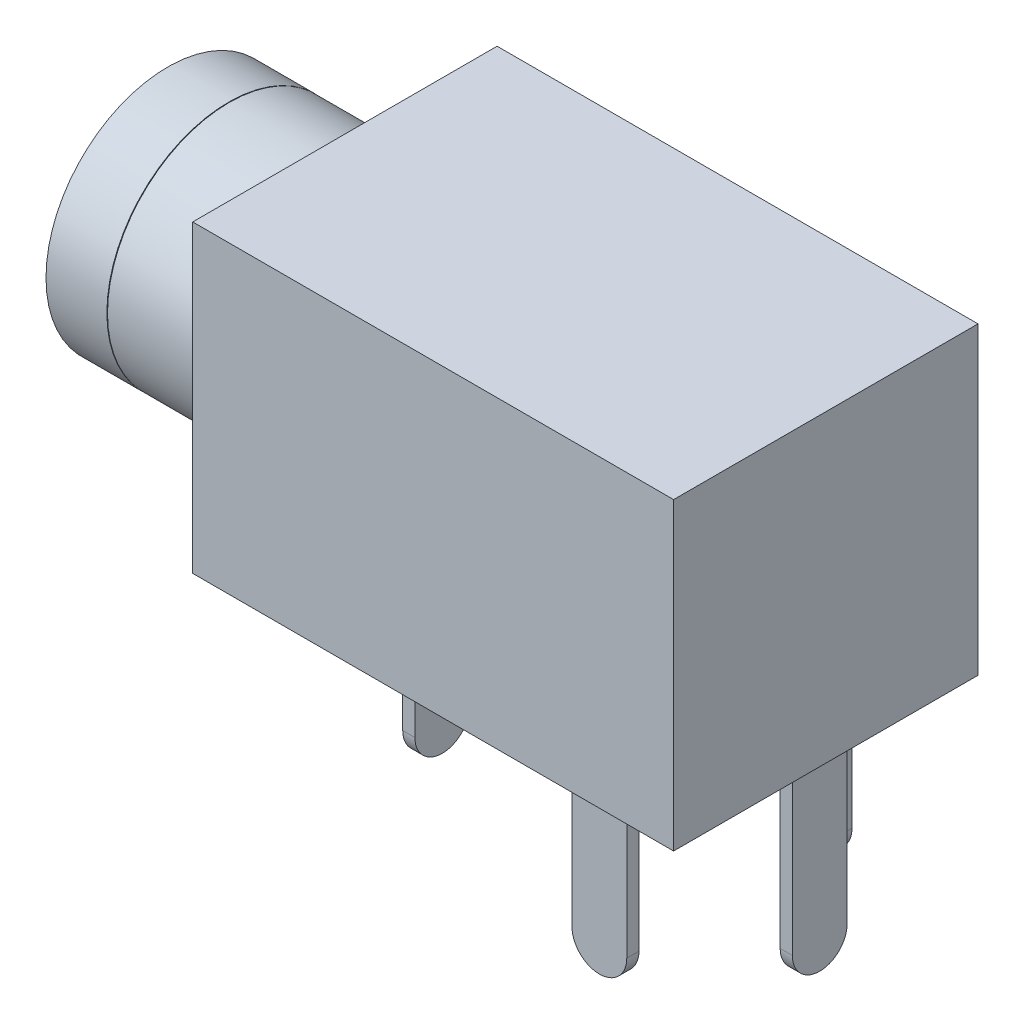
ISO-10303-21;
HEADER;
FILE_DESCRIPTION(('STEP AP214'),'2;1');
FILE_NAME('part.step','',(''),(''),'','','');
FILE_SCHEMA(('AUTOMOTIVE_DESIGN { 1 0 10303 214 1 1 1 1 }'));
ENDSEC;
DATA;
#1=APPLICATION_CONTEXT('core data for automotive mechanical design processes');
#2=APPLICATION_PROTOCOL_DEFINITION('international standard','automotive_design',2000,#1);
#3=PRODUCT_CONTEXT('',#1,'mechanical');
#4=PRODUCT('Part','Part','',(#3));
#5=PRODUCT_RELATED_PRODUCT_CATEGORY('part','',(#4));
#6=PRODUCT_DEFINITION_FORMATION('','',#4);
#7=PRODUCT_DEFINITION_CONTEXT('part definition',#1,'design');
#8=PRODUCT_DEFINITION('design','',#6,#7);
#9=PRODUCT_DEFINITION_SHAPE('','',#8);
#10=(LENGTH_UNIT() NAMED_UNIT(*) SI_UNIT(.MILLI.,.METRE.));
#11=(NAMED_UNIT(*) PLANE_ANGLE_UNIT() SI_UNIT($,.RADIAN.));
#12=(NAMED_UNIT(*) SI_UNIT($,.STERADIAN.) SOLID_ANGLE_UNIT());
#13=UNCERTAINTY_MEASURE_WITH_UNIT(LENGTH_MEASURE(1.E-05),#10,'distance_accuracy_value','');
#14=(GEOMETRIC_REPRESENTATION_CONTEXT(3) GLOBAL_UNCERTAINTY_ASSIGNED_CONTEXT((#13)) GLOBAL_UNIT_ASSIGNED_CONTEXT((#10,
#11,#12)) REPRESENTATION_CONTEXT('',''));
#15=CARTESIAN_POINT('',(0.,0.,0.));
#16=DIRECTION('',(0.,0.,1.));
#17=DIRECTION('',(1.,0.,0.));
#18=AXIS2_PLACEMENT_3D('',#15,#16,#17);
#19=CARTESIAN_POINT('',(1.4,-3.01,0.449999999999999));
#20=DIRECTION('',(1.,0.,0.));
#21=DIRECTION('',(0.,0.,-1.));
#22=AXIS2_PLACEMENT_3D('',#19,#20,#21);
#23=PLANE('',#22);
#24=CARTESIAN_POINT('',(1.4,-2.56,0.));
#25=DIRECTION('',(1.,0.,0.));
#26=DIRECTION('',(0.,0.,-1.));
#27=AXIS2_PLACEMENT_3D('',#24,#25,#26);
#28=CIRCLE('',#27,0.45);
#29=CARTESIAN_POINT('',(1.4,-2.56,-0.450000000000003));
#30=VERTEX_POINT('',#29);
#31=CARTESIAN_POINT('',(1.4,-3.01,0.));
#32=VERTEX_POINT('',#31);
#33=EDGE_CURVE('E94',#30,#32,#28,.F.);
#34=ORIENTED_EDGE('',*,*,#33,.T.);
#35=CARTESIAN_POINT('',(1.4,-2.56,0.));
#36=DIRECTION('',(1.,0.,0.));
#37=DIRECTION('',(0.,0.,-1.));
#38=AXIS2_PLACEMENT_3D('',#35,#36,#37);
#39=CIRCLE('',#38,0.45);
#40=CARTESIAN_POINT('',(1.4,-2.56,0.449999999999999));
#41=VERTEX_POINT('',#40);
#42=EDGE_CURVE('E121',#32,#41,#39,.F.);
#43=ORIENTED_EDGE('',*,*,#42,.T.);
#44=DIRECTION('',(0.,1.,0.));
#45=VECTOR('',#44,1.);
#46=CARTESIAN_POINT('',(1.4,-3.01,0.449999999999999));
#47=LINE('',#46,#45);
#48=CARTESIAN_POINT('',(1.4,-0.01,0.449999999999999));
#49=VERTEX_POINT('',#48);
#50=EDGE_CURVE('E106',#41,#49,#47,.T.);
#51=ORIENTED_EDGE('',*,*,#50,.T.);
#52=DIRECTION('',(0.,0.,-1.));
#53=VECTOR('',#52,1.);
#54=CARTESIAN_POINT('',(1.4,-0.01,0.449999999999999));
#55=LINE('',#54,#53);
#56=CARTESIAN_POINT('',(1.4,-0.01,-0.450000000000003));
#57=VERTEX_POINT('',#56);
#58=EDGE_CURVE('E101',#49,#57,#55,.T.);
#59=ORIENTED_EDGE('',*,*,#58,.T.);
#60=DIRECTION('',(0.,1.,0.));
#61=VECTOR('',#60,1.);
#62=CARTESIAN_POINT('',(1.4,-3.01,-0.450000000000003));
#63=LINE('',#62,#61);
#64=EDGE_CURVE('E85',#30,#57,#63,.T.);
#65=ORIENTED_EDGE('',*,*,#64,.F.);
#66=EDGE_LOOP('',(#34,#43,#51,#59,#65));
#67=FACE_BOUND('',#66,.T.);
#68=ADVANCED_FACE('F43',(#67),#23,.F.);
#69=CARTESIAN_POINT('',(1.4,-3.01,-0.450000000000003));
#70=DIRECTION('',(0.,0.,1.));
#71=DIRECTION('',(1.,0.,0.));
#72=AXIS2_PLACEMENT_3D('',#69,#70,#71);
#73=PLANE('',#72);
#74=DIRECTION('',(0.,1.,0.));
#75=VECTOR('',#74,1.);
#76=CARTESIAN_POINT('',(1.6,-3.01,-0.450000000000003));
#77=LINE('',#76,#75);
#78=CARTESIAN_POINT('',(1.6,-2.56,-0.450000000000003));
#79=VERTEX_POINT('',#78);
#80=CARTESIAN_POINT('',(1.6,-0.01,-0.450000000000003));
#81=VERTEX_POINT('',#80);
#82=EDGE_CURVE('E95',#79,#81,#77,.T.);
#83=ORIENTED_EDGE('',*,*,#82,.F.);
#84=DIRECTION('',(1.,0.,0.));
#85=VECTOR('',#84,1.);
#86=CARTESIAN_POINT('',(1.4,-2.56,-0.450000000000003));
#87=LINE('',#86,#85);
#88=EDGE_CURVE('E12',#79,#30,#87,.F.);
#89=ORIENTED_EDGE('',*,*,#88,.T.);
#90=ORIENTED_EDGE('',*,*,#64,.T.);
#91=DIRECTION('',(1.,0.,0.));
#92=VECTOR('',#91,1.);
#93=CARTESIAN_POINT('',(1.4,-0.01,-0.450000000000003));
#94=LINE('',#93,#92);
#95=EDGE_CURVE('E88',#57,#81,#94,.T.);
#96=ORIENTED_EDGE('',*,*,#95,.T.);
#97=EDGE_LOOP('',(#83,#89,#90,#96));
#98=FACE_BOUND('',#97,.T.);
#99=ADVANCED_FACE('F87',(#98),#73,.F.);
#100=CARTESIAN_POINT('',(1.6,-3.01,0.449999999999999));
#101=DIRECTION('',(-1.,0.,0.));
#102=DIRECTION('',(0.,0.,1.));
#103=AXIS2_PLACEMENT_3D('',#100,#101,#102);
#104=PLANE('',#103);
#105=DIRECTION('',(0.,1.,0.));
#106=VECTOR('',#105,1.);
#107=CARTESIAN_POINT('',(1.6,-3.01,0.449999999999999));
#108=LINE('',#107,#106);
#109=CARTESIAN_POINT('',(1.6,-2.56,0.449999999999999));
#110=VERTEX_POINT('',#109);
#111=CARTESIAN_POINT('',(1.6,-0.01,0.449999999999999));
#112=VERTEX_POINT('',#111);
#113=EDGE_CURVE('E117',#110,#112,#108,.T.);
#114=ORIENTED_EDGE('',*,*,#113,.F.);
#115=CARTESIAN_POINT('',(1.6,-2.56,0.));
#116=DIRECTION('',(-1.,0.,0.));
#117=DIRECTION('',(0.,0.,1.));
#118=AXIS2_PLACEMENT_3D('',#115,#116,#117);
#119=CIRCLE('',#118,0.45);
#120=CARTESIAN_POINT('',(1.6,-3.01,0.));
#121=VERTEX_POINT('',#120);
#122=EDGE_CURVE('E50',#110,#121,#119,.F.);
#123=ORIENTED_EDGE('',*,*,#122,.T.);
#124=CARTESIAN_POINT('',(1.6,-2.56,0.));
#125=DIRECTION('',(-1.,0.,0.));
#126=DIRECTION('',(0.,0.,1.));
#127=AXIS2_PLACEMENT_3D('',#124,#125,#126);
#128=CIRCLE('',#127,0.45);
#129=EDGE_CURVE('E57',#121,#79,#128,.F.);
#130=ORIENTED_EDGE('',*,*,#129,.T.);
#131=ORIENTED_EDGE('',*,*,#82,.T.);
#132=DIRECTION('',(0.,0.,1.));
#133=VECTOR('',#132,1.);
#134=CARTESIAN_POINT('',(1.6,-0.01,0.449999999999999));
#135=LINE('',#134,#133);
#136=EDGE_CURVE('E103',#81,#112,#135,.T.);
#137=ORIENTED_EDGE('',*,*,#136,.T.);
#138=EDGE_LOOP('',(#114,#123,#130,#131,#137));
#139=FACE_BOUND('',#138,.T.);
#140=ADVANCED_FACE('F131',(#139),#104,.F.);
#141=CARTESIAN_POINT('',(1.4,-3.01,0.449999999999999));
#142=DIRECTION('',(0.,0.,-1.));
#143=DIRECTION('',(-1.,0.,0.));
#144=AXIS2_PLACEMENT_3D('',#141,#142,#143);
#145=PLANE('',#144);
#146=ORIENTED_EDGE('',*,*,#50,.F.);
#147=DIRECTION('',(-1.,0.,0.));
#148=VECTOR('',#147,1.);
#149=CARTESIAN_POINT('',(1.6,-2.56,0.449999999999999));
#150=LINE('',#149,#148);
#151=EDGE_CURVE('E123',#41,#110,#150,.F.);
#152=ORIENTED_EDGE('',*,*,#151,.T.);
#153=ORIENTED_EDGE('',*,*,#113,.T.);
#154=DIRECTION('',(-1.,0.,0.));
#155=VECTOR('',#154,1.);
#156=CARTESIAN_POINT('',(1.4,-0.01,0.449999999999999));
#157=LINE('',#156,#155);
#158=EDGE_CURVE('E114',#112,#49,#157,.T.);
#159=ORIENTED_EDGE('',*,*,#158,.T.);
#160=EDGE_LOOP('',(#146,#152,#153,#159));
#161=FACE_BOUND('',#160,.T.);
#162=ADVANCED_FACE('F128',(#161),#145,.F.);
#163=CARTESIAN_POINT('',(1.4,-0.01,-0.450000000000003));
#164=DIRECTION('',(0.,-1.,0.));
#165=DIRECTION('',(0.,0.,-1.));
#166=AXIS2_PLACEMENT_3D('',#163,#164,#165);
#167=PLANE('',#166);
#168=ORIENTED_EDGE('',*,*,#58,.F.);
#169=ORIENTED_EDGE('',*,*,#158,.F.);
#170=ORIENTED_EDGE('',*,*,#136,.F.);
#171=ORIENTED_EDGE('',*,*,#95,.F.);
#172=EDGE_LOOP('',(#168,#169,#170,#171));
#173=FACE_BOUND('',#172,.T.);
#174=ADVANCED_FACE('F99',(#173),#167,.F.);
#175=CARTESIAN_POINT('',(1.4,-2.56,0.));
#176=DIRECTION('',(-1.,0.,0.));
#177=DIRECTION('',(0.,0.,1.));
#178=AXIS2_PLACEMENT_3D('',#175,#176,#177);
#179=CYLINDRICAL_SURFACE('',#178,0.45);
#180=ORIENTED_EDGE('',*,*,#88,.F.);
#181=ORIENTED_EDGE('',*,*,#129,.F.);
#182=DIRECTION('',(1.,0.,0.));
#183=VECTOR('',#182,1.);
#184=CARTESIAN_POINT('',(1.6,-3.01,0.));
#185=LINE('',#184,#183);
#186=EDGE_CURVE('E108',#32,#121,#185,.T.);
#187=ORIENTED_EDGE('',*,*,#186,.F.);
#188=ORIENTED_EDGE('',*,*,#33,.F.);
#189=EDGE_LOOP('',(#180,#181,#187,#188));
#190=FACE_BOUND('',#189,.T.);
#191=ADVANCED_FACE('F133',(#190),#179,.T.);
#192=CARTESIAN_POINT('',(1.4,-2.56,0.));
#193=DIRECTION('',(1.,0.,0.));
#194=DIRECTION('',(0.,0.,-1.));
#195=AXIS2_PLACEMENT_3D('',#192,#193,#194);
#196=CYLINDRICAL_SURFACE('',#195,0.45);
#197=ORIENTED_EDGE('',*,*,#122,.F.);
#198=ORIENTED_EDGE('',*,*,#151,.F.);
#199=ORIENTED_EDGE('',*,*,#42,.F.);
#200=ORIENTED_EDGE('',*,*,#186,.T.);
#201=EDGE_LOOP('',(#197,#198,#199,#200));
#202=FACE_BOUND('',#201,.T.);
#203=ADVANCED_FACE('F135',(#202),#196,.T.);
#204=CLOSED_SHELL('',(#68,#99,#140,#162,#174,#191,#203));
#205=MANIFOLD_SOLID_BREP('B2',#204);
#206=CARTESIAN_POINT('',(7.6,-3.01,0.449999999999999));
#207=DIRECTION('',(1.,0.,0.));
#208=DIRECTION('',(0.,0.,-1.));
#209=AXIS2_PLACEMENT_3D('',#206,#207,#208);
#210=PLANE('',#209);
#211=CARTESIAN_POINT('',(7.6,-2.56,0.));
#212=DIRECTION('',(1.,0.,0.));
#213=DIRECTION('',(0.,0.,-1.));
#214=AXIS2_PLACEMENT_3D('',#211,#212,#213);
#215=CIRCLE('',#214,0.45);
#216=CARTESIAN_POINT('',(7.6,-2.56,-0.449999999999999));
#217=VERTEX_POINT('',#216);
#218=CARTESIAN_POINT('',(7.6,-3.01,0.));
#219=VERTEX_POINT('',#218);
#220=EDGE_CURVE('E253',#217,#219,#215,.F.);
#221=ORIENTED_EDGE('',*,*,#220,.T.);
#222=CARTESIAN_POINT('',(7.6,-2.56,0.));
#223=DIRECTION('',(1.,0.,0.));
#224=DIRECTION('',(0.,0.,-1.));
#225=AXIS2_PLACEMENT_3D('',#222,#223,#224);
#226=CIRCLE('',#225,0.45);
#227=CARTESIAN_POINT('',(7.6,-2.56,0.449999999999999));
#228=VERTEX_POINT('',#227);
#229=EDGE_CURVE('E280',#219,#228,#226,.F.);
#230=ORIENTED_EDGE('',*,*,#229,.T.);
#231=DIRECTION('',(0.,1.,0.));
#232=VECTOR('',#231,1.);
#233=CARTESIAN_POINT('',(7.6,-3.01,0.449999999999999));
#234=LINE('',#233,#232);
#235=CARTESIAN_POINT('',(7.6,-0.01,0.449999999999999));
#236=VERTEX_POINT('',#235);
#237=EDGE_CURVE('E265',#228,#236,#234,.T.);
#238=ORIENTED_EDGE('',*,*,#237,.T.);
#239=DIRECTION('',(0.,0.,-1.));
#240=VECTOR('',#239,1.);
#241=CARTESIAN_POINT('',(7.6,-0.01,0.449999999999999));
#242=LINE('',#241,#240);
#243=CARTESIAN_POINT('',(7.6,-0.01,-0.449999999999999));
#244=VERTEX_POINT('',#243);
#245=EDGE_CURVE('E260',#236,#244,#242,.T.);
#246=ORIENTED_EDGE('',*,*,#245,.T.);
#247=DIRECTION('',(0.,1.,0.));
#248=VECTOR('',#247,1.);
#249=CARTESIAN_POINT('',(7.6,-3.01,-0.449999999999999));
#250=LINE('',#249,#248);
#251=EDGE_CURVE('E244',#217,#244,#250,.T.);
#252=ORIENTED_EDGE('',*,*,#251,.F.);
#253=EDGE_LOOP('',(#221,#230,#238,#246,#252));
#254=FACE_BOUND('',#253,.T.);
#255=ADVANCED_FACE('F202',(#254),#210,.F.);
#256=CARTESIAN_POINT('',(7.6,-3.01,-0.449999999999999));
#257=DIRECTION('',(0.,0.,1.));
#258=DIRECTION('',(1.,0.,0.));
#259=AXIS2_PLACEMENT_3D('',#256,#257,#258);
#260=PLANE('',#259);
#261=DIRECTION('',(0.,1.,0.));
#262=VECTOR('',#261,1.);
#263=CARTESIAN_POINT('',(7.8,-3.01,-0.449999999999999));
#264=LINE('',#263,#262);
#265=CARTESIAN_POINT('',(7.8,-2.56,-0.449999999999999));
#266=VERTEX_POINT('',#265);
#267=CARTESIAN_POINT('',(7.8,-0.01,-0.449999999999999));
#268=VERTEX_POINT('',#267);
#269=EDGE_CURVE('E254',#266,#268,#264,.T.);
#270=ORIENTED_EDGE('',*,*,#269,.F.);
#271=DIRECTION('',(1.,0.,0.));
#272=VECTOR('',#271,1.);
#273=CARTESIAN_POINT('',(7.6,-2.56,-0.449999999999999));
#274=LINE('',#273,#272);
#275=EDGE_CURVE('E41',#266,#217,#274,.F.);
#276=ORIENTED_EDGE('',*,*,#275,.T.);
#277=ORIENTED_EDGE('',*,*,#251,.T.);
#278=DIRECTION('',(1.,0.,0.));
#279=VECTOR('',#278,1.);
#280=CARTESIAN_POINT('',(7.6,-0.01,-0.449999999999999));
#281=LINE('',#280,#279);
#282=EDGE_CURVE('E247',#244,#268,#281,.T.);
#283=ORIENTED_EDGE('',*,*,#282,.T.);
#284=EDGE_LOOP('',(#270,#276,#277,#283));
#285=FACE_BOUND('',#284,.T.);
#286=ADVANCED_FACE('F246',(#285),#260,.F.);
#287=CARTESIAN_POINT('',(7.8,-3.01,0.449999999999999));
#288=DIRECTION('',(-1.,0.,0.));
#289=DIRECTION('',(0.,0.,1.));
#290=AXIS2_PLACEMENT_3D('',#287,#288,#289);
#291=PLANE('',#290);
#292=DIRECTION('',(0.,1.,0.));
#293=VECTOR('',#292,1.);
#294=CARTESIAN_POINT('',(7.8,-3.01,0.449999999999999));
#295=LINE('',#294,#293);
#296=CARTESIAN_POINT('',(7.8,-2.56,0.449999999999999));
#297=VERTEX_POINT('',#296);
#298=CARTESIAN_POINT('',(7.8,-0.01,0.449999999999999));
#299=VERTEX_POINT('',#298);
#300=EDGE_CURVE('E276',#297,#299,#295,.T.);
#301=ORIENTED_EDGE('',*,*,#300,.F.);
#302=CARTESIAN_POINT('',(7.8,-2.56,0.));
#303=DIRECTION('',(-1.,0.,0.));
#304=DIRECTION('',(0.,0.,1.));
#305=AXIS2_PLACEMENT_3D('',#302,#303,#304);
#306=CIRCLE('',#305,0.45);
#307=CARTESIAN_POINT('',(7.8,-3.01,0.));
#308=VERTEX_POINT('',#307);
#309=EDGE_CURVE('E209',#297,#308,#306,.F.);
#310=ORIENTED_EDGE('',*,*,#309,.T.);
#311=CARTESIAN_POINT('',(7.8,-2.56,0.));
#312=DIRECTION('',(-1.,0.,0.));
#313=DIRECTION('',(0.,0.,1.));
#314=AXIS2_PLACEMENT_3D('',#311,#312,#313);
#315=CIRCLE('',#314,0.45);
#316=EDGE_CURVE('E216',#308,#266,#315,.F.);
#317=ORIENTED_EDGE('',*,*,#316,.T.);
#318=ORIENTED_EDGE('',*,*,#269,.T.);
#319=DIRECTION('',(0.,0.,1.));
#320=VECTOR('',#319,1.);
#321=CARTESIAN_POINT('',(7.8,-0.01,0.449999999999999));
#322=LINE('',#321,#320);
#323=EDGE_CURVE('E262',#268,#299,#322,.T.);
#324=ORIENTED_EDGE('',*,*,#323,.T.);
#325=EDGE_LOOP('',(#301,#310,#317,#318,#324));
#326=FACE_BOUND('',#325,.T.);
#327=ADVANCED_FACE('F290',(#326),#291,.F.);
#328=CARTESIAN_POINT('',(7.6,-3.01,0.449999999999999));
#329=DIRECTION('',(0.,0.,-1.));
#330=DIRECTION('',(-1.,0.,0.));
#331=AXIS2_PLACEMENT_3D('',#328,#329,#330);
#332=PLANE('',#331);
#333=ORIENTED_EDGE('',*,*,#237,.F.);
#334=DIRECTION('',(-1.,0.,0.));
#335=VECTOR('',#334,1.);
#336=CARTESIAN_POINT('',(7.8,-2.56,0.449999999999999));
#337=LINE('',#336,#335);
#338=EDGE_CURVE('E282',#228,#297,#337,.F.);
#339=ORIENTED_EDGE('',*,*,#338,.T.);
#340=ORIENTED_EDGE('',*,*,#300,.T.);
#341=DIRECTION('',(-1.,0.,0.));
#342=VECTOR('',#341,1.);
#343=CARTESIAN_POINT('',(7.6,-0.01,0.449999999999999));
#344=LINE('',#343,#342);
#345=EDGE_CURVE('E273',#299,#236,#344,.T.);
#346=ORIENTED_EDGE('',*,*,#345,.T.);
#347=EDGE_LOOP('',(#333,#339,#340,#346));
#348=FACE_BOUND('',#347,.T.);
#349=ADVANCED_FACE('F287',(#348),#332,.F.);
#350=CARTESIAN_POINT('',(7.6,-0.01,-0.449999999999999));
#351=DIRECTION('',(0.,-1.,0.));
#352=DIRECTION('',(0.,0.,-1.));
#353=AXIS2_PLACEMENT_3D('',#350,#351,#352);
#354=PLANE('',#353);
#355=ORIENTED_EDGE('',*,*,#245,.F.);
#356=ORIENTED_EDGE('',*,*,#345,.F.);
#357=ORIENTED_EDGE('',*,*,#323,.F.);
#358=ORIENTED_EDGE('',*,*,#282,.F.);
#359=EDGE_LOOP('',(#355,#356,#357,#358));
#360=FACE_BOUND('',#359,.T.);
#361=ADVANCED_FACE('F258',(#360),#354,.F.);
#362=CARTESIAN_POINT('',(7.6,-2.56,0.));
#363=DIRECTION('',(-1.,0.,0.));
#364=DIRECTION('',(0.,0.,1.));
#365=AXIS2_PLACEMENT_3D('',#362,#363,#364);
#366=CYLINDRICAL_SURFACE('',#365,0.45);
#367=ORIENTED_EDGE('',*,*,#275,.F.);
#368=ORIENTED_EDGE('',*,*,#316,.F.);
#369=DIRECTION('',(1.,0.,0.));
#370=VECTOR('',#369,1.);
#371=CARTESIAN_POINT('',(7.8,-3.01,0.));
#372=LINE('',#371,#370);
#373=EDGE_CURVE('E267',#219,#308,#372,.T.);
#374=ORIENTED_EDGE('',*,*,#373,.F.);
#375=ORIENTED_EDGE('',*,*,#220,.F.);
#376=EDGE_LOOP('',(#367,#368,#374,#375));
#377=FACE_BOUND('',#376,.T.);
#378=ADVANCED_FACE('F292',(#377),#366,.T.);
#379=CARTESIAN_POINT('',(7.6,-2.56,0.));
#380=DIRECTION('',(1.,0.,0.));
#381=DIRECTION('',(0.,0.,-1.));
#382=AXIS2_PLACEMENT_3D('',#379,#380,#381);
#383=CYLINDRICAL_SURFACE('',#382,0.45);
#384=ORIENTED_EDGE('',*,*,#309,.F.);
#385=ORIENTED_EDGE('',*,*,#338,.F.);
#386=ORIENTED_EDGE('',*,*,#229,.F.);
#387=ORIENTED_EDGE('',*,*,#373,.T.);
#388=EDGE_LOOP('',(#384,#385,#386,#387));
#389=FACE_BOUND('',#388,.T.);
#390=ADVANCED_FACE('F294',(#389),#383,.T.);
#391=CLOSED_SHELL('',(#255,#286,#327,#349,#361,#378,#390));
#392=MANIFOLD_SOLID_BREP('B6',#391);
#393=CARTESIAN_POINT('',(5.58025319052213,-3.01,1.65));
#394=DIRECTION('',(0.,0.,1.));
#395=DIRECTION('',(1.,0.,0.));
#396=AXIS2_PLACEMENT_3D('',#393,#394,#395);
#397=PLANE('',#396);
#398=CARTESIAN_POINT('',(6.03025319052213,-2.56,1.65));
#399=DIRECTION('',(0.,0.,1.));
#400=DIRECTION('',(1.,0.,0.));
#401=AXIS2_PLACEMENT_3D('',#398,#399,#400);
#402=CIRCLE('',#401,0.45);
#403=CARTESIAN_POINT('',(6.48025319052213,-2.56,1.65));
#404=VERTEX_POINT('',#403);
#405=CARTESIAN_POINT('',(6.03025319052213,-3.01,1.65));
#406=VERTEX_POINT('',#405);
#407=EDGE_CURVE('E412',#404,#406,#402,.F.);
#408=ORIENTED_EDGE('',*,*,#407,.T.);
#409=CARTESIAN_POINT('',(6.03025319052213,-2.56,1.65));
#410=DIRECTION('',(0.,0.,1.));
#411=DIRECTION('',(1.,0.,0.));
#412=AXIS2_PLACEMENT_3D('',#409,#410,#411);
#413=CIRCLE('',#412,0.45);
#414=CARTESIAN_POINT('',(5.58025319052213,-2.56,1.65));
#415=VERTEX_POINT('',#414);
#416=EDGE_CURVE('E439',#406,#415,#413,.F.);
#417=ORIENTED_EDGE('',*,*,#416,.T.);
#418=DIRECTION('',(0.,1.,0.));
#419=VECTOR('',#418,1.);
#420=CARTESIAN_POINT('',(5.58025319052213,-3.01,1.65));
#421=LINE('',#420,#419);
#422=CARTESIAN_POINT('',(5.58025319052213,-0.01,1.65));
#423=VERTEX_POINT('',#422);
#424=EDGE_CURVE('E424',#415,#423,#421,.T.);
#425=ORIENTED_EDGE('',*,*,#424,.T.);
#426=DIRECTION('',(1.,0.,0.));
#427=VECTOR('',#426,1.);
#428=CARTESIAN_POINT('',(5.58025319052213,-0.01,1.65));
#429=LINE('',#428,#427);
#430=CARTESIAN_POINT('',(6.48025319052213,-0.01,1.65));
#431=VERTEX_POINT('',#430);
#432=EDGE_CURVE('E419',#423,#431,#429,.T.);
#433=ORIENTED_EDGE('',*,*,#432,.T.);
#434=DIRECTION('',(0.,1.,0.));
#435=VECTOR('',#434,1.);
#436=CARTESIAN_POINT('',(6.48025319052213,-3.01,1.65));
#437=LINE('',#436,#435);
#438=EDGE_CURVE('E403',#404,#431,#437,.T.);
#439=ORIENTED_EDGE('',*,*,#438,.F.);
#440=EDGE_LOOP('',(#408,#417,#425,#433,#439));
#441=FACE_BOUND('',#440,.T.);
#442=ADVANCED_FACE('F361',(#441),#397,.F.);
#443=CARTESIAN_POINT('',(6.48025319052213,-3.01,1.65));
#444=DIRECTION('',(-1.,0.,0.));
#445=DIRECTION('',(0.,0.,1.));
#446=AXIS2_PLACEMENT_3D('',#443,#444,#445);
#447=PLANE('',#446);
#448=DIRECTION('',(0.,1.,0.));
#449=VECTOR('',#448,1.);
#450=CARTESIAN_POINT('',(6.48025319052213,-3.01,1.85));
#451=LINE('',#450,#449);
#452=CARTESIAN_POINT('',(6.48025319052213,-2.56,1.85));
#453=VERTEX_POINT('',#452);
#454=CARTESIAN_POINT('',(6.48025319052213,-0.01,1.85));
#455=VERTEX_POINT('',#454);
#456=EDGE_CURVE('E413',#453,#455,#451,.T.);
#457=ORIENTED_EDGE('',*,*,#456,.F.);
#458=DIRECTION('',(0.,0.,1.));
#459=VECTOR('',#458,1.);
#460=CARTESIAN_POINT('',(6.48025319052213,-2.56,1.65));
#461=LINE('',#460,#459);
#462=EDGE_CURVE('E200',#453,#404,#461,.F.);
#463=ORIENTED_EDGE('',*,*,#462,.T.);
#464=ORIENTED_EDGE('',*,*,#438,.T.);
#465=DIRECTION('',(0.,0.,1.));
#466=VECTOR('',#465,1.);
#467=CARTESIAN_POINT('',(6.48025319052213,-0.01,1.65));
#468=LINE('',#467,#466);
#469=EDGE_CURVE('E406',#431,#455,#468,.T.);
#470=ORIENTED_EDGE('',*,*,#469,.T.);
#471=EDGE_LOOP('',(#457,#463,#464,#470));
#472=FACE_BOUND('',#471,.T.);
#473=ADVANCED_FACE('F405',(#472),#447,.F.);
#474=CARTESIAN_POINT('',(5.58025319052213,-3.01,1.85));
#475=DIRECTION('',(0.,0.,-1.));
#476=DIRECTION('',(-1.,0.,0.));
#477=AXIS2_PLACEMENT_3D('',#474,#475,#476);
#478=PLANE('',#477);
#479=DIRECTION('',(0.,1.,0.));
#480=VECTOR('',#479,1.);
#481=CARTESIAN_POINT('',(5.58025319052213,-3.01,1.85));
#482=LINE('',#481,#480);
#483=CARTESIAN_POINT('',(5.58025319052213,-2.56,1.85));
#484=VERTEX_POINT('',#483);
#485=CARTESIAN_POINT('',(5.58025319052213,-0.01,1.85));
#486=VERTEX_POINT('',#485);
#487=EDGE_CURVE('E435',#484,#486,#482,.T.);
#488=ORIENTED_EDGE('',*,*,#487,.F.);
#489=CARTESIAN_POINT('',(6.03025319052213,-2.56,1.85));
#490=DIRECTION('',(0.,0.,-1.));
#491=DIRECTION('',(-1.,0.,0.));
#492=AXIS2_PLACEMENT_3D('',#489,#490,#491);
#493=CIRCLE('',#492,0.45);
#494=CARTESIAN_POINT('',(6.03025319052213,-3.01,1.85));
#495=VERTEX_POINT('',#494);
#496=EDGE_CURVE('E368',#484,#495,#493,.F.);
#497=ORIENTED_EDGE('',*,*,#496,.T.);
#498=CARTESIAN_POINT('',(6.03025319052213,-2.56,1.85));
#499=DIRECTION('',(0.,0.,-1.));
#500=DIRECTION('',(-1.,0.,0.));
#501=AXIS2_PLACEMENT_3D('',#498,#499,#500);
#502=CIRCLE('',#501,0.45);
#503=EDGE_CURVE('E375',#495,#453,#502,.F.);
#504=ORIENTED_EDGE('',*,*,#503,.T.);
#505=ORIENTED_EDGE('',*,*,#456,.T.);
#506=DIRECTION('',(-1.,0.,0.));
#507=VECTOR('',#506,1.);
#508=CARTESIAN_POINT('',(5.58025319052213,-0.01,1.85));
#509=LINE('',#508,#507);
#510=EDGE_CURVE('E421',#455,#486,#509,.T.);
#511=ORIENTED_EDGE('',*,*,#510,.T.);
#512=EDGE_LOOP('',(#488,#497,#504,#505,#511));
#513=FACE_BOUND('',#512,.T.);
#514=ADVANCED_FACE('F449',(#513),#478,.F.);
#515=CARTESIAN_POINT('',(5.58025319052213,-3.01,1.65));
#516=DIRECTION('',(1.,0.,0.));
#517=DIRECTION('',(0.,0.,-1.));
#518=AXIS2_PLACEMENT_3D('',#515,#516,#517);
#519=PLANE('',#518);
#520=ORIENTED_EDGE('',*,*,#424,.F.);
#521=DIRECTION('',(0.,0.,-1.));
#522=VECTOR('',#521,1.);
#523=CARTESIAN_POINT('',(5.58025319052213,-2.56,1.85));
#524=LINE('',#523,#522);
#525=EDGE_CURVE('E441',#415,#484,#524,.F.);
#526=ORIENTED_EDGE('',*,*,#525,.T.);
#527=ORIENTED_EDGE('',*,*,#487,.T.);
#528=DIRECTION('',(0.,0.,-1.));
#529=VECTOR('',#528,1.);
#530=CARTESIAN_POINT('',(5.58025319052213,-0.01,1.65));
#531=LINE('',#530,#529);
#532=EDGE_CURVE('E432',#486,#423,#531,.T.);
#533=ORIENTED_EDGE('',*,*,#532,.T.);
#534=EDGE_LOOP('',(#520,#526,#527,#533));
#535=FACE_BOUND('',#534,.T.);
#536=ADVANCED_FACE('F446',(#535),#519,.F.);
#537=CARTESIAN_POINT('',(6.48025319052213,-0.01,1.65));
#538=DIRECTION('',(0.,-1.,0.));
#539=DIRECTION('',(0.,0.,-1.));
#540=AXIS2_PLACEMENT_3D('',#537,#538,#539);
#541=PLANE('',#540);
#542=ORIENTED_EDGE('',*,*,#432,.F.);
#543=ORIENTED_EDGE('',*,*,#532,.F.);
#544=ORIENTED_EDGE('',*,*,#510,.F.);
#545=ORIENTED_EDGE('',*,*,#469,.F.);
#546=EDGE_LOOP('',(#542,#543,#544,#545));
#547=FACE_BOUND('',#546,.T.);
#548=ADVANCED_FACE('F417',(#547),#541,.F.);
#549=CARTESIAN_POINT('',(6.03025319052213,-2.56,1.65));
#550=DIRECTION('',(0.,0.,-1.));
#551=DIRECTION('',(-1.,0.,0.));
#552=AXIS2_PLACEMENT_3D('',#549,#550,#551);
#553=CYLINDRICAL_SURFACE('',#552,0.45);
#554=ORIENTED_EDGE('',*,*,#462,.F.);
#555=ORIENTED_EDGE('',*,*,#503,.F.);
#556=DIRECTION('',(0.,0.,1.));
#557=VECTOR('',#556,1.);
#558=CARTESIAN_POINT('',(6.03025319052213,-3.01,1.85));
#559=LINE('',#558,#557);
#560=EDGE_CURVE('E426',#406,#495,#559,.T.);
#561=ORIENTED_EDGE('',*,*,#560,.F.);
#562=ORIENTED_EDGE('',*,*,#407,.F.);
#563=EDGE_LOOP('',(#554,#555,#561,#562));
#564=FACE_BOUND('',#563,.T.);
#565=ADVANCED_FACE('F451',(#564),#553,.T.);
#566=CARTESIAN_POINT('',(6.03025319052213,-2.56,1.65));
#567=DIRECTION('',(0.,0.,1.));
#568=DIRECTION('',(1.,0.,0.));
#569=AXIS2_PLACEMENT_3D('',#566,#567,#568);
#570=CYLINDRICAL_SURFACE('',#569,0.45);
#571=ORIENTED_EDGE('',*,*,#496,.F.);
#572=ORIENTED_EDGE('',*,*,#525,.F.);
#573=ORIENTED_EDGE('',*,*,#416,.F.);
#574=ORIENTED_EDGE('',*,*,#560,.T.);
#575=EDGE_LOOP('',(#571,#572,#573,#574));
#576=FACE_BOUND('',#575,.T.);
#577=ADVANCED_FACE('F453',(#576),#570,.T.);
#578=CLOSED_SHELL('',(#442,#473,#514,#536,#548,#565,#577));
#579=MANIFOLD_SOLID_BREP('B35',#578);
#580=CARTESIAN_POINT('',(5.58025319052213,-3.01,-1.65));
#581=DIRECTION('',(1.,0.,0.));
#582=DIRECTION('',(0.,0.,-1.));
#583=AXIS2_PLACEMENT_3D('',#580,#581,#582);
#584=PLANE('',#583);
#585=DIRECTION('',(0.,1.,0.));
#586=VECTOR('',#585,1.);
#587=CARTESIAN_POINT('',(5.58025319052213,-3.01,-1.85));
#588=LINE('',#587,#586);
#589=CARTESIAN_POINT('',(5.58025319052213,-2.56,-1.85));
#590=VERTEX_POINT('',#589);
#591=CARTESIAN_POINT('',(5.58025319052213,-0.01,-1.85));
#592=VERTEX_POINT('',#591);
#593=EDGE_CURVE('E558',#590,#592,#588,.T.);
#594=ORIENTED_EDGE('',*,*,#593,.F.);
#595=DIRECTION('',(0.,0.,-1.));
#596=VECTOR('',#595,1.);
#597=CARTESIAN_POINT('',(5.58025319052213,-2.56,-1.65));
#598=LINE('',#597,#596);
#599=CARTESIAN_POINT('',(5.58025319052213,-2.56,-1.65));
#600=VERTEX_POINT('',#599);
#601=EDGE_CURVE('E359',#590,#600,#598,.F.);
#602=ORIENTED_EDGE('',*,*,#601,.T.);
#603=DIRECTION('',(0.,1.,0.));
#604=VECTOR('',#603,1.);
#605=CARTESIAN_POINT('',(5.58025319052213,-3.01,-1.65));
#606=LINE('',#605,#604);
#607=CARTESIAN_POINT('',(5.58025319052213,-0.01,-1.65));
#608=VERTEX_POINT('',#607);
#609=EDGE_CURVE('E578',#600,#608,#606,.T.);
#610=ORIENTED_EDGE('',*,*,#609,.T.);
#611=DIRECTION('',(0.,0.,-1.));
#612=VECTOR('',#611,1.);
#613=CARTESIAN_POINT('',(5.58025319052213,-0.01,-1.65));
#614=LINE('',#613,#612);
#615=EDGE_CURVE('E573',#608,#592,#614,.T.);
#616=ORIENTED_EDGE('',*,*,#615,.T.);
#617=EDGE_LOOP('',(#594,#602,#610,#616));
#618=FACE_BOUND('',#617,.T.);
#619=ADVANCED_FACE('F518',(#618),#584,.F.);
#620=CARTESIAN_POINT('',(5.58025319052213,-3.01,-1.85));
#621=DIRECTION('',(0.,0.,1.));
#622=DIRECTION('',(1.,0.,0.));
#623=AXIS2_PLACEMENT_3D('',#620,#621,#622);
#624=PLANE('',#623);
#625=DIRECTION('',(0.,1.,0.));
#626=VECTOR('',#625,1.);
#627=CARTESIAN_POINT('',(6.48025319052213,-3.01,-1.85));
#628=LINE('',#627,#626);
#629=CARTESIAN_POINT('',(6.48025319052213,-2.56,-1.85));
#630=VERTEX_POINT('',#629);
#631=CARTESIAN_POINT('',(6.48025319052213,-0.01,-1.85));
#632=VERTEX_POINT('',#631);
#633=EDGE_CURVE('E567',#630,#632,#628,.T.);
#634=ORIENTED_EDGE('',*,*,#633,.F.);
#635=CARTESIAN_POINT('',(6.03025319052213,-2.56,-1.85));
#636=DIRECTION('',(0.,0.,1.));
#637=DIRECTION('',(1.,0.,0.));
#638=AXIS2_PLACEMENT_3D('',#635,#636,#637);
#639=CIRCLE('',#638,0.45);
#640=CARTESIAN_POINT('',(6.03025319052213,-3.01,-1.85));
#641=VERTEX_POINT('',#640);
#642=EDGE_CURVE('E525',#630,#641,#639,.F.);
#643=ORIENTED_EDGE('',*,*,#642,.T.);
#644=CARTESIAN_POINT('',(6.03025319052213,-2.56,-1.85));
#645=DIRECTION('',(0.,0.,1.));
#646=DIRECTION('',(1.,0.,0.));
#647=AXIS2_PLACEMENT_3D('',#644,#645,#646);
#648=CIRCLE('',#647,0.45);
#649=EDGE_CURVE('E532',#641,#590,#648,.F.);
#650=ORIENTED_EDGE('',*,*,#649,.T.);
#651=ORIENTED_EDGE('',*,*,#593,.T.);
#652=DIRECTION('',(1.,0.,0.));
#653=VECTOR('',#652,1.);
#654=CARTESIAN_POINT('',(5.58025319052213,-0.01,-1.85));
#655=LINE('',#654,#653);
#656=EDGE_CURVE('E561',#592,#632,#655,.T.);
#657=ORIENTED_EDGE('',*,*,#656,.T.);
#658=EDGE_LOOP('',(#634,#643,#650,#651,#657));
#659=FACE_BOUND('',#658,.T.);
#660=ADVANCED_FACE('F560',(#659),#624,.F.);
#661=CARTESIAN_POINT('',(6.48025319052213,-3.01,-1.65));
#662=DIRECTION('',(-1.,0.,0.));
#663=DIRECTION('',(0.,0.,1.));
#664=AXIS2_PLACEMENT_3D('',#661,#662,#663);
#665=PLANE('',#664);
#666=DIRECTION('',(0.,1.,0.));
#667=VECTOR('',#666,1.);
#668=CARTESIAN_POINT('',(6.48025319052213,-3.01,-1.65));
#669=LINE('',#668,#667);
#670=CARTESIAN_POINT('',(6.48025319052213,-2.56,-1.65));
#671=VERTEX_POINT('',#670);
#672=CARTESIAN_POINT('',(6.48025319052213,-0.01,-1.65));
#673=VERTEX_POINT('',#672);
#674=EDGE_CURVE('E589',#671,#673,#669,.T.);
#675=ORIENTED_EDGE('',*,*,#674,.F.);
#676=DIRECTION('',(0.,0.,1.));
#677=VECTOR('',#676,1.);
#678=CARTESIAN_POINT('',(6.48025319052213,-2.56,-1.85));
#679=LINE('',#678,#677);
#680=EDGE_CURVE('E595',#671,#630,#679,.F.);
#681=ORIENTED_EDGE('',*,*,#680,.T.);
#682=ORIENTED_EDGE('',*,*,#633,.T.);
#683=DIRECTION('',(0.,0.,1.));
#684=VECTOR('',#683,1.);
#685=CARTESIAN_POINT('',(6.48025319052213,-0.01,-1.65));
#686=LINE('',#685,#684);
#687=EDGE_CURVE('E575',#632,#673,#686,.T.);
#688=ORIENTED_EDGE('',*,*,#687,.T.);
#689=EDGE_LOOP('',(#675,#681,#682,#688));
#690=FACE_BOUND('',#689,.T.);
#691=ADVANCED_FACE('F601',(#690),#665,.F.);
#692=CARTESIAN_POINT('',(5.58025319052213,-3.01,-1.65));
#693=DIRECTION('',(0.,0.,-1.));
#694=DIRECTION('',(-1.,0.,0.));
#695=AXIS2_PLACEMENT_3D('',#692,#693,#694);
#696=PLANE('',#695);
#697=CARTESIAN_POINT('',(6.03025319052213,-2.56,-1.65));
#698=DIRECTION('',(0.,0.,-1.));
#699=DIRECTION('',(-1.,0.,0.));
#700=AXIS2_PLACEMENT_3D('',#697,#698,#699);
#701=CIRCLE('',#700,0.45);
#702=CARTESIAN_POINT('',(6.03025319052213,-3.01,-1.65));
#703=VERTEX_POINT('',#702);
#704=EDGE_CURVE('E566',#600,#703,#701,.F.);
#705=ORIENTED_EDGE('',*,*,#704,.T.);
#706=CARTESIAN_POINT('',(6.03025319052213,-2.56,-1.65));
#707=DIRECTION('',(0.,0.,-1.));
#708=DIRECTION('',(-1.,0.,0.));
#709=AXIS2_PLACEMENT_3D('',#706,#707,#708);
#710=CIRCLE('',#709,0.45);
#711=EDGE_CURVE('E593',#703,#671,#710,.F.);
#712=ORIENTED_EDGE('',*,*,#711,.T.);
#713=ORIENTED_EDGE('',*,*,#674,.T.);
#714=DIRECTION('',(-1.,0.,0.));
#715=VECTOR('',#714,1.);
#716=CARTESIAN_POINT('',(5.58025319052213,-0.01,-1.65));
#717=LINE('',#716,#715);
#718=EDGE_CURVE('E586',#673,#608,#717,.T.);
#719=ORIENTED_EDGE('',*,*,#718,.T.);
#720=ORIENTED_EDGE('',*,*,#609,.F.);
#721=EDGE_LOOP('',(#705,#712,#713,#719,#720));
#722=FACE_BOUND('',#721,.T.);
#723=ADVANCED_FACE('F610',(#722),#696,.F.);
#724=CARTESIAN_POINT('',(5.58025319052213,-0.01,-1.85));
#725=DIRECTION('',(0.,-1.,0.));
#726=DIRECTION('',(0.,0.,-1.));
#727=AXIS2_PLACEMENT_3D('',#724,#725,#726);
#728=PLANE('',#727);
#729=ORIENTED_EDGE('',*,*,#615,.F.);
#730=ORIENTED_EDGE('',*,*,#718,.F.);
#731=ORIENTED_EDGE('',*,*,#687,.F.);
#732=ORIENTED_EDGE('',*,*,#656,.F.);
#733=EDGE_LOOP('',(#729,#730,#731,#732));
#734=FACE_BOUND('',#733,.T.);
#735=ADVANCED_FACE('F571',(#734),#728,.F.);
#736=CARTESIAN_POINT('',(6.03025319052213,-2.56,-1.85));
#737=DIRECTION('',(0.,0.,1.));
#738=DIRECTION('',(1.,0.,0.));
#739=AXIS2_PLACEMENT_3D('',#736,#737,#738);
#740=CYLINDRICAL_SURFACE('',#739,0.45);
#741=ORIENTED_EDGE('',*,*,#601,.F.);
#742=ORIENTED_EDGE('',*,*,#649,.F.);
#743=DIRECTION('',(0.,0.,-1.));
#744=VECTOR('',#743,1.);
#745=CARTESIAN_POINT('',(6.03025319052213,-3.01,-1.85));
#746=LINE('',#745,#744);
#747=EDGE_CURVE('E580',#703,#641,#746,.T.);
#748=ORIENTED_EDGE('',*,*,#747,.F.);
#749=ORIENTED_EDGE('',*,*,#704,.F.);
#750=EDGE_LOOP('',(#741,#742,#748,#749));
#751=FACE_BOUND('',#750,.T.);
#752=ADVANCED_FACE('F608',(#751),#740,.T.);
#753=CARTESIAN_POINT('',(6.03025319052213,-2.56,-1.85));
#754=DIRECTION('',(0.,0.,-1.));
#755=DIRECTION('',(-1.,0.,0.));
#756=AXIS2_PLACEMENT_3D('',#753,#754,#755);
#757=CYLINDRICAL_SURFACE('',#756,0.45);
#758=ORIENTED_EDGE('',*,*,#642,.F.);
#759=ORIENTED_EDGE('',*,*,#680,.F.);
#760=ORIENTED_EDGE('',*,*,#711,.F.);
#761=ORIENTED_EDGE('',*,*,#747,.T.);
#762=EDGE_LOOP('',(#758,#759,#760,#761));
#763=FACE_BOUND('',#762,.T.);
#764=ADVANCED_FACE('F604',(#763),#757,.T.);
#765=CLOSED_SHELL('',(#619,#660,#691,#723,#735,#752,#764));
#766=MANIFOLD_SOLID_BREP('B194',#765);
#767=CARTESIAN_POINT('',(-2.91,2.5,0.));
#768=DIRECTION('',(-1.,0.,0.));
#769=DIRECTION('',(0.,0.,1.));
#770=AXIS2_PLACEMENT_3D('',#767,#768,#769);
#771=PLANE('',#770);
#772=CARTESIAN_POINT('',(-2.91,2.5,0.));
#773=DIRECTION('',(-1.,0.,0.));
#774=DIRECTION('',(0.,0.,1.));
#775=AXIS2_PLACEMENT_3D('',#772,#773,#774);
#776=CIRCLE('',#775,2.);
#777=CARTESIAN_POINT('',(-2.91,2.5,2.));
#778=VERTEX_POINT('',#777);
#779=EDGE_CURVE('E517',#778,#778,#776,.T.);
#780=ORIENTED_EDGE('',*,*,#779,.T.);
#781=EDGE_LOOP('',(#780));
#782=FACE_BOUND('',#781,.T.);
#783=CARTESIAN_POINT('',(-2.91,2.5,0.));
#784=DIRECTION('',(-1.,0.,0.));
#785=DIRECTION('',(0.,0.,1.));
#786=AXIS2_PLACEMENT_3D('',#783,#784,#785);
#787=CIRCLE('',#786,1.25);
#788=CARTESIAN_POINT('',(-2.91,2.5,1.25));
#789=VERTEX_POINT('',#788);
#790=EDGE_CURVE('E687',#789,#789,#787,.T.);
#791=ORIENTED_EDGE('',*,*,#790,.F.);
#792=EDGE_LOOP('',(#791));
#793=FACE_BOUND('',#792,.T.);
#794=ADVANCED_FACE('F676',(#782,#793),#771,.T.);
#795=CARTESIAN_POINT('',(-1.91,2.5,0.));
#796=DIRECTION('',(-1.,0.,0.));
#797=DIRECTION('',(0.,0.,1.));
#798=AXIS2_PLACEMENT_3D('',#795,#796,#797);
#799=PLANE('',#798);
#800=CARTESIAN_POINT('',(-1.91,2.5,0.));
#801=DIRECTION('',(-1.,0.,0.));
#802=DIRECTION('',(0.,0.,1.));
#803=AXIS2_PLACEMENT_3D('',#800,#801,#802);
#804=CIRCLE('',#803,2.);
#805=CARTESIAN_POINT('',(-1.91,2.5,2.));
#806=VERTEX_POINT('',#805);
#807=EDGE_CURVE('E683',#806,#806,#804,.T.);
#808=ORIENTED_EDGE('',*,*,#807,.F.);
#809=EDGE_LOOP('',(#808));
#810=FACE_BOUND('',#809,.T.);
#811=CARTESIAN_POINT('',(-1.91,2.5,0.));
#812=DIRECTION('',(-1.,0.,0.));
#813=DIRECTION('',(0.,0.,1.));
#814=AXIS2_PLACEMENT_3D('',#811,#812,#813);
#815=CIRCLE('',#814,1.25);
#816=CARTESIAN_POINT('',(-1.91,2.5,1.25));
#817=VERTEX_POINT('',#816);
#818=EDGE_CURVE('E691',#817,#817,#815,.T.);
#819=ORIENTED_EDGE('',*,*,#818,.T.);
#820=EDGE_LOOP('',(#819));
#821=FACE_BOUND('',#820,.T.);
#822=ADVANCED_FACE('F697',(#810,#821),#799,.F.);
#823=CARTESIAN_POINT('',(-2.91,2.5,0.));
#824=DIRECTION('',(1.,0.,0.));
#825=DIRECTION('',(0.,0.,-1.));
#826=AXIS2_PLACEMENT_3D('',#823,#824,#825);
#827=CYLINDRICAL_SURFACE('',#826,2.);
#828=ORIENTED_EDGE('',*,*,#779,.F.);
#829=EDGE_LOOP('',(#828));
#830=FACE_BOUND('',#829,.T.);
#831=ORIENTED_EDGE('',*,*,#807,.T.);
#832=EDGE_LOOP('',(#831));
#833=FACE_BOUND('',#832,.T.);
#834=ADVANCED_FACE('F678',(#830,#833),#827,.T.);
#835=CARTESIAN_POINT('',(-2.91,2.5,0.));
#836=DIRECTION('',(1.,0.,0.));
#837=DIRECTION('',(0.,0.,-1.));
#838=AXIS2_PLACEMENT_3D('',#835,#836,#837);
#839=CYLINDRICAL_SURFACE('',#838,1.25);
#840=ORIENTED_EDGE('',*,*,#790,.T.);
#841=EDGE_LOOP('',(#840));
#842=FACE_BOUND('',#841,.T.);
#843=ORIENTED_EDGE('',*,*,#818,.F.);
#844=EDGE_LOOP('',(#843));
#845=FACE_BOUND('',#844,.T.);
#846=ADVANCED_FACE('F699',(#842,#845),#839,.F.);
#847=CLOSED_SHELL('',(#794,#822,#834,#846));
#848=MANIFOLD_SOLID_BREP('B353',#847);
#849=CARTESIAN_POINT('',(0.,0.,2.5));
#850=DIRECTION('',(0.,1.,0.));
#851=DIRECTION('',(0.,0.,1.));
#852=AXIS2_PLACEMENT_3D('',#849,#850,#851);
#853=PLANE('',#852);
#854=DIRECTION('',(0.,0.,1.));
#855=VECTOR('',#854,1.);
#856=CARTESIAN_POINT('',(0.,0.,-2.5));
#857=LINE('',#856,#855);
#858=CARTESIAN_POINT('',(0.,0.,-2.5));
#859=VERTEX_POINT('',#858);
#860=CARTESIAN_POINT('',(0.,0.,2.5));
#861=VERTEX_POINT('',#860);
#862=EDGE_CURVE('E783',#859,#861,#857,.T.);
#863=ORIENTED_EDGE('',*,*,#862,.F.);
#864=DIRECTION('',(-1.,0.,0.));
#865=VECTOR('',#864,1.);
#866=CARTESIAN_POINT('',(0.,0.,-2.5));
#867=LINE('',#866,#865);
#868=CARTESIAN_POINT('',(7.9,0.,-2.5));
#869=VERTEX_POINT('',#868);
#870=EDGE_CURVE('E808',#869,#859,#867,.T.);
#871=ORIENTED_EDGE('',*,*,#870,.F.);
#872=DIRECTION('',(0.,0.,-1.));
#873=VECTOR('',#872,1.);
#874=CARTESIAN_POINT('',(7.9,0.,-2.5));
#875=LINE('',#874,#873);
#876=CARTESIAN_POINT('',(7.9,0.,2.5));
#877=VERTEX_POINT('',#876);
#878=EDGE_CURVE('E784',#877,#869,#875,.T.);
#879=ORIENTED_EDGE('',*,*,#878,.F.);
#880=DIRECTION('',(1.,0.,0.));
#881=VECTOR('',#880,1.);
#882=CARTESIAN_POINT('',(0.,0.,2.5));
#883=LINE('',#882,#881);
#884=EDGE_CURVE('E778',#861,#877,#883,.T.);
#885=ORIENTED_EDGE('',*,*,#884,.F.);
#886=EDGE_LOOP('',(#863,#871,#879,#885));
#887=FACE_BOUND('',#886,.T.);
#888=CARTESIAN_POINT('',(3.5,0.,0.));
#889=DIRECTION('',(0.,1.,0.));
#890=DIRECTION('',(0.,0.,1.));
#891=AXIS2_PLACEMENT_3D('',#888,#889,#890);
#892=CIRCLE('',#891,0.5);
#893=CARTESIAN_POINT('',(3.5,0.,0.5));
#894=VERTEX_POINT('',#893);
#895=EDGE_CURVE('E674',#894,#894,#892,.F.);
#896=ORIENTED_EDGE('',*,*,#895,.F.);
#897=EDGE_LOOP('',(#896));
#898=FACE_BOUND('',#897,.T.);
#899=ADVANCED_FACE('F737',(#887,#898),#853,.F.);
#900=CARTESIAN_POINT('',(0.,5.,-2.5));
#901=DIRECTION('',(1.,0.,0.));
#902=DIRECTION('',(0.,0.,-1.));
#903=AXIS2_PLACEMENT_3D('',#900,#901,#902);
#904=PLANE('',#903);
#905=ORIENTED_EDGE('',*,*,#862,.T.);
#906=DIRECTION('',(0.,-1.,0.));
#907=VECTOR('',#906,1.);
#908=CARTESIAN_POINT('',(0.,5.,2.5));
#909=LINE('',#908,#907);
#910=CARTESIAN_POINT('',(0.,5.,2.5));
#911=VERTEX_POINT('',#910);
#912=EDGE_CURVE('E790',#911,#861,#909,.T.);
#913=ORIENTED_EDGE('',*,*,#912,.F.);
#914=DIRECTION('',(0.,0.,1.));
#915=VECTOR('',#914,1.);
#916=CARTESIAN_POINT('',(0.,5.,-2.5));
#917=LINE('',#916,#915);
#918=CARTESIAN_POINT('',(0.,5.,-2.5));
#919=VERTEX_POINT('',#918);
#920=EDGE_CURVE('E810',#919,#911,#917,.T.);
#921=ORIENTED_EDGE('',*,*,#920,.F.);
#922=DIRECTION('',(0.,-1.,0.));
#923=VECTOR('',#922,1.);
#924=CARTESIAN_POINT('',(0.,5.,-2.5));
#925=LINE('',#924,#923);
#926=EDGE_CURVE('E799',#919,#859,#925,.T.);
#927=ORIENTED_EDGE('',*,*,#926,.T.);
#928=EDGE_LOOP('',(#905,#913,#921,#927));
#929=FACE_BOUND('',#928,.T.);
#930=CARTESIAN_POINT('',(0.,2.5,0.));
#931=DIRECTION('',(1.,0.,0.));
#932=DIRECTION('',(0.,0.,-1.));
#933=AXIS2_PLACEMENT_3D('',#930,#931,#932);
#934=CIRCLE('',#933,2.);
#935=CARTESIAN_POINT('',(0.,2.5,-2.));
#936=VERTEX_POINT('',#935);
#937=EDGE_CURVE('E745',#936,#936,#934,.F.);
#938=ORIENTED_EDGE('',*,*,#937,.F.);
#939=EDGE_LOOP('',(#938));
#940=FACE_BOUND('',#939,.T.);
#941=ADVANCED_FACE('F739',(#929,#940),#904,.F.);
#942=CARTESIAN_POINT('',(0.,5.,2.5));
#943=DIRECTION('',(0.,0.,-1.));
#944=DIRECTION('',(-1.,0.,0.));
#945=AXIS2_PLACEMENT_3D('',#942,#943,#944);
#946=PLANE('',#945);
#947=ORIENTED_EDGE('',*,*,#884,.T.);
#948=DIRECTION('',(0.,-1.,0.));
#949=VECTOR('',#948,1.);
#950=CARTESIAN_POINT('',(7.9,5.,2.5));
#951=LINE('',#950,#949);
#952=CARTESIAN_POINT('',(7.9,5.,2.5));
#953=VERTEX_POINT('',#952);
#954=EDGE_CURVE('E795',#953,#877,#951,.T.);
#955=ORIENTED_EDGE('',*,*,#954,.F.);
#956=DIRECTION('',(1.,0.,0.));
#957=VECTOR('',#956,1.);
#958=CARTESIAN_POINT('',(0.,5.,2.5));
#959=LINE('',#958,#957);
#960=EDGE_CURVE('E792',#911,#953,#959,.T.);
#961=ORIENTED_EDGE('',*,*,#960,.F.);
#962=ORIENTED_EDGE('',*,*,#912,.T.);
#963=EDGE_LOOP('',(#947,#955,#961,#962));
#964=FACE_BOUND('',#963,.T.);
#965=ADVANCED_FACE('F791',(#964),#946,.F.);
#966=CARTESIAN_POINT('',(7.9,5.,-2.5));
#967=DIRECTION('',(-1.,0.,0.));
#968=DIRECTION('',(0.,0.,1.));
#969=AXIS2_PLACEMENT_3D('',#966,#967,#968);
#970=PLANE('',#969);
#971=ORIENTED_EDGE('',*,*,#878,.T.);
#972=DIRECTION('',(0.,-1.,0.));
#973=VECTOR('',#972,1.);
#974=CARTESIAN_POINT('',(7.9,5.,-2.5));
#975=LINE('',#974,#973);
#976=CARTESIAN_POINT('',(7.9,5.,-2.5));
#977=VERTEX_POINT('',#976);
#978=EDGE_CURVE('E816',#977,#869,#975,.T.);
#979=ORIENTED_EDGE('',*,*,#978,.F.);
#980=DIRECTION('',(0.,0.,-1.));
#981=VECTOR('',#980,1.);
#982=CARTESIAN_POINT('',(7.9,5.,-2.5));
#983=LINE('',#982,#981);
#984=EDGE_CURVE('E757',#953,#977,#983,.T.);
#985=ORIENTED_EDGE('',*,*,#984,.F.);
#986=ORIENTED_EDGE('',*,*,#954,.T.);
#987=EDGE_LOOP('',(#971,#979,#985,#986));
#988=FACE_BOUND('',#987,.T.);
#989=ADVANCED_FACE('F828',(#988),#970,.F.);
#990=CARTESIAN_POINT('',(0.,5.,-2.5));
#991=DIRECTION('',(0.,0.,1.));
#992=DIRECTION('',(1.,0.,0.));
#993=AXIS2_PLACEMENT_3D('',#990,#991,#992);
#994=PLANE('',#993);
#995=ORIENTED_EDGE('',*,*,#870,.T.);
#996=ORIENTED_EDGE('',*,*,#926,.F.);
#997=DIRECTION('',(-1.,0.,0.));
#998=VECTOR('',#997,1.);
#999=CARTESIAN_POINT('',(0.,5.,-2.5));
#1000=LINE('',#999,#998);
#1001=EDGE_CURVE('E752',#977,#919,#1000,.T.);
#1002=ORIENTED_EDGE('',*,*,#1001,.F.);
#1003=ORIENTED_EDGE('',*,*,#978,.T.);
#1004=EDGE_LOOP('',(#995,#996,#1002,#1003));
#1005=FACE_BOUND('',#1004,.T.);
#1006=ADVANCED_FACE('F838',(#1005),#994,.F.);
#1007=CARTESIAN_POINT('',(0.,5.,2.5));
#1008=DIRECTION('',(0.,1.,0.));
#1009=DIRECTION('',(0.,0.,1.));
#1010=AXIS2_PLACEMENT_3D('',#1007,#1008,#1009);
#1011=PLANE('',#1010);
#1012=ORIENTED_EDGE('',*,*,#920,.T.);
#1013=ORIENTED_EDGE('',*,*,#960,.T.);
#1014=ORIENTED_EDGE('',*,*,#984,.T.);
#1015=ORIENTED_EDGE('',*,*,#1001,.T.);
#1016=EDGE_LOOP('',(#1012,#1013,#1014,#1015));
#1017=FACE_BOUND('',#1016,.T.);
#1018=ADVANCED_FACE('F835',(#1017),#1011,.T.);
#1019=CARTESIAN_POINT('',(-1.9,2.5,0.));
#1020=DIRECTION('',(1.,0.,0.));
#1021=DIRECTION('',(0.,0.,-1.));
#1022=AXIS2_PLACEMENT_3D('',#1019,#1020,#1021);
#1023=CYLINDRICAL_SURFACE('',#1022,2.);
#1024=CARTESIAN_POINT('',(-1.9,2.5,0.));
#1025=DIRECTION('',(-1.,0.,0.));
#1026=DIRECTION('',(0.,0.,1.));
#1027=AXIS2_PLACEMENT_3D('',#1024,#1025,#1026);
#1028=CIRCLE('',#1027,2.);
#1029=CARTESIAN_POINT('',(-1.9,2.5,2.));
#1030=VERTEX_POINT('',#1029);
#1031=EDGE_CURVE('E800',#1030,#1030,#1028,.T.);
#1032=ORIENTED_EDGE('',*,*,#1031,.F.);
#1033=EDGE_LOOP('',(#1032));
#1034=FACE_BOUND('',#1033,.T.);
#1035=ORIENTED_EDGE('',*,*,#937,.T.);
#1036=EDGE_LOOP('',(#1035));
#1037=FACE_BOUND('',#1036,.T.);
#1038=ADVANCED_FACE('F822',(#1034,#1037),#1023,.T.);
#1039=CARTESIAN_POINT('',(-1.9,2.5,0.));
#1040=DIRECTION('',(-1.,0.,0.));
#1041=DIRECTION('',(0.,0.,1.));
#1042=AXIS2_PLACEMENT_3D('',#1039,#1040,#1041);
#1043=PLANE('',#1042);
#1044=ORIENTED_EDGE('',*,*,#1031,.T.);
#1045=EDGE_LOOP('',(#1044));
#1046=FACE_BOUND('',#1045,.T.);
#1047=ADVANCED_FACE('F862',(#1046),#1043,.T.);
#1048=CARTESIAN_POINT('',(3.5,-2.,0.));
#1049=DIRECTION('',(0.,1.,0.));
#1050=DIRECTION('',(0.,0.,1.));
#1051=AXIS2_PLACEMENT_3D('',#1048,#1049,#1050);
#1052=CYLINDRICAL_SURFACE('',#1051,0.5);
#1053=CARTESIAN_POINT('',(3.5,-2.,0.));
#1054=DIRECTION('',(0.,-1.,0.));
#1055=DIRECTION('',(0.,0.,-1.));
#1056=AXIS2_PLACEMENT_3D('',#1053,#1054,#1055);
#1057=CIRCLE('',#1056,0.5);
#1058=CARTESIAN_POINT('',(3.5,-2.,-0.5));
#1059=VERTEX_POINT('',#1058);
#1060=EDGE_CURVE('E803',#1059,#1059,#1057,.T.);
#1061=ORIENTED_EDGE('',*,*,#1060,.F.);
#1062=EDGE_LOOP('',(#1061));
#1063=FACE_BOUND('',#1062,.T.);
#1064=ORIENTED_EDGE('',*,*,#895,.T.);
#1065=EDGE_LOOP('',(#1064));
#1066=FACE_BOUND('',#1065,.T.);
#1067=ADVANCED_FACE('F869',(#1063,#1066),#1052,.T.);
#1068=CARTESIAN_POINT('',(3.5,-2.,0.));
#1069=DIRECTION('',(0.,-1.,0.));
#1070=DIRECTION('',(0.,0.,-1.));
#1071=AXIS2_PLACEMENT_3D('',#1068,#1069,#1070);
#1072=PLANE('',#1071);
#1073=ORIENTED_EDGE('',*,*,#1060,.T.);
#1074=EDGE_LOOP('',(#1073));
#1075=FACE_BOUND('',#1074,.T.);
#1076=ADVANCED_FACE('F876',(#1075),#1072,.T.);
#1077=CLOSED_SHELL('',(#899,#941,#965,#989,#1006,#1018,#1038,#1047,#1067,#1076));
#1078=MANIFOLD_SOLID_BREP('B512',#1077);
#1079=ADVANCED_BREP_SHAPE_REPRESENTATION('',(#18,#205,#392,#579,#766,#848,#1078),#14);
#1080=SHAPE_DEFINITION_REPRESENTATION(#9,#1079);
ENDSEC;
END-ISO-10303-21;
